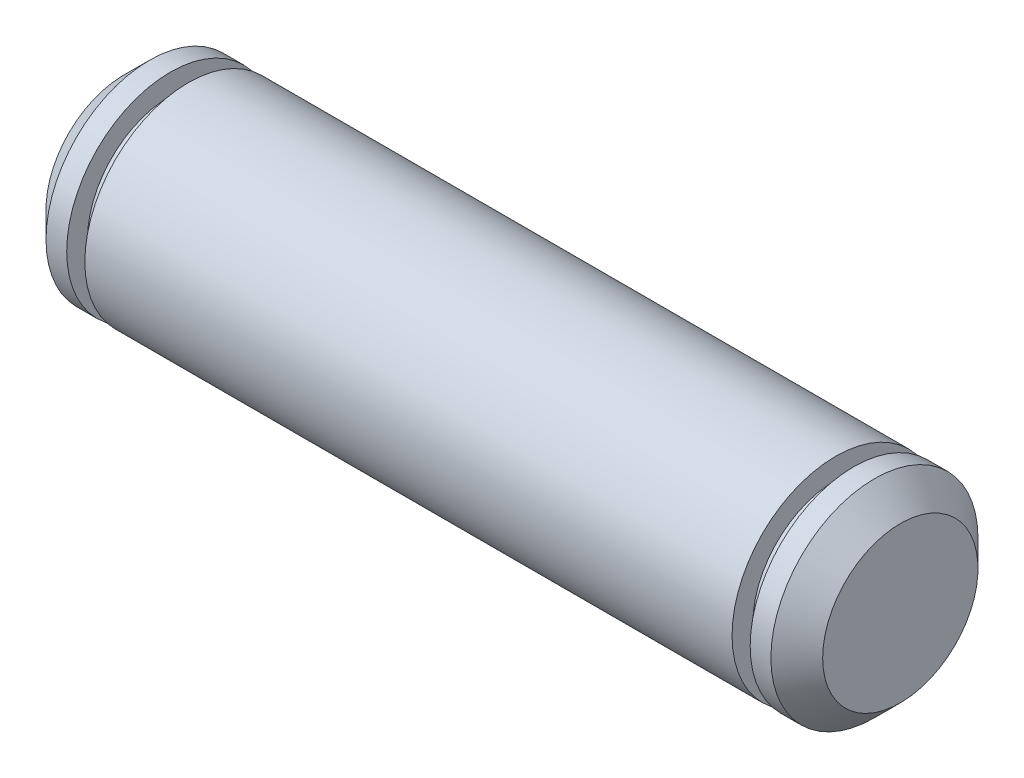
ISO-10303-21;
HEADER;
FILE_DESCRIPTION(('STEP AP214'),'2;1');
FILE_NAME('part.step','',(''),(''),'','','');
FILE_SCHEMA(('AUTOMOTIVE_DESIGN { 1 0 10303 214 1 1 1 1 }'));
ENDSEC;
DATA;
#1=APPLICATION_CONTEXT('core data for automotive mechanical design processes');
#2=APPLICATION_PROTOCOL_DEFINITION('international standard','automotive_design',2000,#1);
#3=PRODUCT_CONTEXT('',#1,'mechanical');
#4=PRODUCT('Part','Part','',(#3));
#5=PRODUCT_RELATED_PRODUCT_CATEGORY('part','',(#4));
#6=PRODUCT_DEFINITION_FORMATION('','',#4);
#7=PRODUCT_DEFINITION_CONTEXT('part definition',#1,'design');
#8=PRODUCT_DEFINITION('design','',#6,#7);
#9=PRODUCT_DEFINITION_SHAPE('','',#8);
#10=(LENGTH_UNIT() NAMED_UNIT(*) SI_UNIT(.MILLI.,.METRE.));
#11=(NAMED_UNIT(*) PLANE_ANGLE_UNIT() SI_UNIT($,.RADIAN.));
#12=(NAMED_UNIT(*) SI_UNIT($,.STERADIAN.) SOLID_ANGLE_UNIT());
#13=UNCERTAINTY_MEASURE_WITH_UNIT(LENGTH_MEASURE(1.E-05),#10,'distance_accuracy_value','');
#14=(GEOMETRIC_REPRESENTATION_CONTEXT(3) GLOBAL_UNCERTAINTY_ASSIGNED_CONTEXT((#13)) GLOBAL_UNIT_ASSIGNED_CONTEXT((#10,
#11,#12)) REPRESENTATION_CONTEXT('',''));
#15=CARTESIAN_POINT('',(0.,0.,0.));
#16=DIRECTION('',(0.,0.,1.));
#17=DIRECTION('',(1.,0.,0.));
#18=AXIS2_PLACEMENT_3D('',#15,#16,#17);
#19=CARTESIAN_POINT('',(-51.8,30.8,0.));
#20=DIRECTION('',(-1.,0.,0.));
#21=DIRECTION('',(0.,0.,1.));
#22=AXIS2_PLACEMENT_3D('',#19,#20,#21);
#23=PLANE('',#22);
#24=CARTESIAN_POINT('',(-51.8,26.8,0.));
#25=DIRECTION('',(-1.,0.,0.));
#26=DIRECTION('',(0.,0.,1.));
#27=AXIS2_PLACEMENT_3D('',#24,#25,#26);
#28=CIRCLE('',#27,3.);
#29=CARTESIAN_POINT('',(-51.8,26.8,3.));
#30=VERTEX_POINT('',#29);
#31=EDGE_CURVE('E10',#30,#30,#28,.F.);
#32=ORIENTED_EDGE('',*,*,#31,.T.);
#33=EDGE_LOOP('',(#32));
#34=FACE_BOUND('',#33,.T.);
#35=ADVANCED_FACE('F32',(#34),#23,.F.);
#36=CARTESIAN_POINT('',(-101.8,26.8,0.));
#37=DIRECTION('',(-1.,0.,0.));
#38=DIRECTION('',(0.,0.,1.));
#39=AXIS2_PLACEMENT_3D('',#36,#37,#38);
#40=CYLINDRICAL_SURFACE('',#39,4.00000000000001);
#41=CARTESIAN_POINT('',(-52.8,26.8,0.));
#42=DIRECTION('',(-1.,0.,0.));
#43=DIRECTION('',(0.,0.,1.));
#44=AXIS2_PLACEMENT_3D('',#41,#42,#43);
#45=CIRCLE('',#44,4.00000000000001);
#46=CARTESIAN_POINT('',(-52.8,26.8,4.00000000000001));
#47=VERTEX_POINT('',#46);
#48=EDGE_CURVE('E38',#47,#47,#45,.T.);
#49=ORIENTED_EDGE('',*,*,#48,.T.);
#50=EDGE_LOOP('',(#49));
#51=FACE_BOUND('',#50,.T.);
#52=CARTESIAN_POINT('',(-53.6,26.8,0.));
#53=DIRECTION('',(-1.,0.,0.));
#54=DIRECTION('',(0.,0.,1.));
#55=AXIS2_PLACEMENT_3D('',#52,#53,#54);
#56=CIRCLE('',#55,4.00000000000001);
#57=CARTESIAN_POINT('',(-53.6,26.8,4.00000000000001));
#58=VERTEX_POINT('',#57);
#59=EDGE_CURVE('E51',#58,#58,#56,.T.);
#60=ORIENTED_EDGE('',*,*,#59,.F.);
#61=EDGE_LOOP('',(#60));
#62=FACE_BOUND('',#61,.T.);
#63=ADVANCED_FACE('F117',(#51,#62),#40,.T.);
#64=CARTESIAN_POINT('',(-53.6,30.,0.));
#65=DIRECTION('',(1.,0.,0.));
#66=DIRECTION('',(0.,0.,-1.));
#67=AXIS2_PLACEMENT_3D('',#64,#65,#66);
#68=PLANE('',#67);
#69=CARTESIAN_POINT('',(-53.6,26.8,0.));
#70=DIRECTION('',(-1.,0.,0.));
#71=DIRECTION('',(0.,0.,1.));
#72=AXIS2_PLACEMENT_3D('',#69,#70,#71);
#73=CIRCLE('',#72,3.2);
#74=CARTESIAN_POINT('',(-53.6,26.8,3.2));
#75=VERTEX_POINT('',#74);
#76=EDGE_CURVE('E54',#75,#75,#73,.T.);
#77=ORIENTED_EDGE('',*,*,#76,.F.);
#78=EDGE_LOOP('',(#77));
#79=FACE_BOUND('',#78,.T.);
#80=ORIENTED_EDGE('',*,*,#59,.T.);
#81=EDGE_LOOP('',(#80));
#82=FACE_BOUND('',#81,.T.);
#83=ADVANCED_FACE('F111',(#79,#82),#68,.F.);
#84=CARTESIAN_POINT('',(-101.8,26.8,0.));
#85=DIRECTION('',(-1.,0.,0.));
#86=DIRECTION('',(0.,0.,1.));
#87=AXIS2_PLACEMENT_3D('',#84,#85,#86);
#88=CYLINDRICAL_SURFACE('',#87,3.2);
#89=CARTESIAN_POINT('',(-54.3,26.8,0.));
#90=DIRECTION('',(-1.,0.,0.));
#91=DIRECTION('',(0.,0.,1.));
#92=AXIS2_PLACEMENT_3D('',#89,#90,#91);
#93=CIRCLE('',#92,3.2);
#94=CARTESIAN_POINT('',(-54.3,26.8,3.2));
#95=VERTEX_POINT('',#94);
#96=EDGE_CURVE('E57',#95,#95,#93,.T.);
#97=ORIENTED_EDGE('',*,*,#96,.F.);
#98=EDGE_LOOP('',(#97));
#99=FACE_BOUND('',#98,.T.);
#100=ORIENTED_EDGE('',*,*,#76,.T.);
#101=EDGE_LOOP('',(#100));
#102=FACE_BOUND('',#101,.T.);
#103=ADVANCED_FACE('F105',(#99,#102),#88,.T.);
#104=CARTESIAN_POINT('',(-54.3,30.8,0.));
#105=DIRECTION('',(-1.,0.,0.));
#106=DIRECTION('',(0.,0.,1.));
#107=AXIS2_PLACEMENT_3D('',#104,#105,#106);
#108=PLANE('',#107);
#109=CARTESIAN_POINT('',(-54.3,26.8,0.));
#110=DIRECTION('',(-1.,0.,0.));
#111=DIRECTION('',(0.,0.,1.));
#112=AXIS2_PLACEMENT_3D('',#109,#110,#111);
#113=CIRCLE('',#112,4.00000000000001);
#114=CARTESIAN_POINT('',(-54.3,26.8,4.00000000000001));
#115=VERTEX_POINT('',#114);
#116=EDGE_CURVE('E60',#115,#115,#113,.T.);
#117=ORIENTED_EDGE('',*,*,#116,.F.);
#118=EDGE_LOOP('',(#117));
#119=FACE_BOUND('',#118,.T.);
#120=ORIENTED_EDGE('',*,*,#96,.T.);
#121=EDGE_LOOP('',(#120));
#122=FACE_BOUND('',#121,.T.);
#123=ADVANCED_FACE('F99',(#119,#122),#108,.F.);
#124=CARTESIAN_POINT('',(-101.8,26.8,0.));
#125=DIRECTION('',(-1.,0.,0.));
#126=DIRECTION('',(0.,0.,1.));
#127=AXIS2_PLACEMENT_3D('',#124,#125,#126);
#128=CYLINDRICAL_SURFACE('',#127,4.00000000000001);
#129=CARTESIAN_POINT('',(-79.3,26.8,0.));
#130=DIRECTION('',(-1.,0.,0.));
#131=DIRECTION('',(0.,0.,1.));
#132=AXIS2_PLACEMENT_3D('',#129,#130,#131);
#133=CIRCLE('',#132,4.00000000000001);
#134=CARTESIAN_POINT('',(-79.3,26.8,4.00000000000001));
#135=VERTEX_POINT('',#134);
#136=EDGE_CURVE('E63',#135,#135,#133,.T.);
#137=ORIENTED_EDGE('',*,*,#136,.F.);
#138=EDGE_LOOP('',(#137));
#139=FACE_BOUND('',#138,.T.);
#140=ORIENTED_EDGE('',*,*,#116,.T.);
#141=EDGE_LOOP('',(#140));
#142=FACE_BOUND('',#141,.T.);
#143=ADVANCED_FACE('F93',(#139,#142),#128,.T.);
#144=CARTESIAN_POINT('',(-79.3,30.,0.));
#145=DIRECTION('',(1.,0.,0.));
#146=DIRECTION('',(0.,0.,-1.));
#147=AXIS2_PLACEMENT_3D('',#144,#145,#146);
#148=PLANE('',#147);
#149=CARTESIAN_POINT('',(-79.3,26.8,0.));
#150=DIRECTION('',(-1.,0.,0.));
#151=DIRECTION('',(0.,0.,1.));
#152=AXIS2_PLACEMENT_3D('',#149,#150,#151);
#153=CIRCLE('',#152,3.20000000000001);
#154=CARTESIAN_POINT('',(-79.3,26.8,3.20000000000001));
#155=VERTEX_POINT('',#154);
#156=EDGE_CURVE('E66',#155,#155,#153,.T.);
#157=ORIENTED_EDGE('',*,*,#156,.F.);
#158=EDGE_LOOP('',(#157));
#159=FACE_BOUND('',#158,.T.);
#160=ORIENTED_EDGE('',*,*,#136,.T.);
#161=EDGE_LOOP('',(#160));
#162=FACE_BOUND('',#161,.T.);
#163=ADVANCED_FACE('F87',(#159,#162),#148,.F.);
#164=CARTESIAN_POINT('',(-101.8,26.8,0.));
#165=DIRECTION('',(-1.,0.,0.));
#166=DIRECTION('',(0.,0.,1.));
#167=AXIS2_PLACEMENT_3D('',#164,#165,#166);
#168=CYLINDRICAL_SURFACE('',#167,3.20000000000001);
#169=CARTESIAN_POINT('',(-80.,26.8,0.));
#170=DIRECTION('',(-1.,0.,0.));
#171=DIRECTION('',(0.,0.,1.));
#172=AXIS2_PLACEMENT_3D('',#169,#170,#171);
#173=CIRCLE('',#172,3.20000000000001);
#174=CARTESIAN_POINT('',(-80.,26.8,3.20000000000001));
#175=VERTEX_POINT('',#174);
#176=EDGE_CURVE('E69',#175,#175,#173,.T.);
#177=ORIENTED_EDGE('',*,*,#176,.F.);
#178=EDGE_LOOP('',(#177));
#179=FACE_BOUND('',#178,.T.);
#180=ORIENTED_EDGE('',*,*,#156,.T.);
#181=EDGE_LOOP('',(#180));
#182=FACE_BOUND('',#181,.T.);
#183=ADVANCED_FACE('F81',(#179,#182),#168,.T.);
#184=CARTESIAN_POINT('',(-80.,30.8,0.));
#185=DIRECTION('',(-1.,0.,0.));
#186=DIRECTION('',(0.,0.,1.));
#187=AXIS2_PLACEMENT_3D('',#184,#185,#186);
#188=PLANE('',#187);
#189=CARTESIAN_POINT('',(-80.,26.8,0.));
#190=DIRECTION('',(-1.,0.,0.));
#191=DIRECTION('',(0.,0.,1.));
#192=AXIS2_PLACEMENT_3D('',#189,#190,#191);
#193=CIRCLE('',#192,4.00000000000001);
#194=CARTESIAN_POINT('',(-80.,26.8,4.00000000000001));
#195=VERTEX_POINT('',#194);
#196=EDGE_CURVE('E72',#195,#195,#193,.T.);
#197=ORIENTED_EDGE('',*,*,#196,.F.);
#198=EDGE_LOOP('',(#197));
#199=FACE_BOUND('',#198,.T.);
#200=ORIENTED_EDGE('',*,*,#176,.T.);
#201=EDGE_LOOP('',(#200));
#202=FACE_BOUND('',#201,.T.);
#203=ADVANCED_FACE('F78',(#199,#202),#188,.F.);
#204=CARTESIAN_POINT('',(-101.8,26.8,0.));
#205=DIRECTION('',(-1.,0.,0.));
#206=DIRECTION('',(0.,0.,1.));
#207=AXIS2_PLACEMENT_3D('',#204,#205,#206);
#208=CYLINDRICAL_SURFACE('',#207,4.00000000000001);
#209=CARTESIAN_POINT('',(-80.8,26.8,0.));
#210=DIRECTION('',(1.,0.,0.));
#211=DIRECTION('',(0.,0.,-1.));
#212=AXIS2_PLACEMENT_3D('',#209,#210,#211);
#213=CIRCLE('',#212,4.00000000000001);
#214=CARTESIAN_POINT('',(-80.8,26.8,-4.00000000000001));
#215=VERTEX_POINT('',#214);
#216=EDGE_CURVE('E42',#215,#215,#213,.T.);
#217=ORIENTED_EDGE('',*,*,#216,.T.);
#218=EDGE_LOOP('',(#217));
#219=FACE_BOUND('',#218,.T.);
#220=ORIENTED_EDGE('',*,*,#196,.T.);
#221=EDGE_LOOP('',(#220));
#222=FACE_BOUND('',#221,.T.);
#223=ADVANCED_FACE('F76',(#219,#222),#208,.T.);
#224=CARTESIAN_POINT('',(-81.8,26.8,0.));
#225=DIRECTION('',(1.,0.,0.));
#226=DIRECTION('',(0.,0.,-1.));
#227=AXIS2_PLACEMENT_3D('',#224,#225,#226);
#228=PLANE('',#227);
#229=CARTESIAN_POINT('',(-81.8,26.8,0.));
#230=DIRECTION('',(1.,0.,0.));
#231=DIRECTION('',(0.,0.,-1.));
#232=AXIS2_PLACEMENT_3D('',#229,#230,#231);
#233=CIRCLE('',#232,2.99999999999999);
#234=CARTESIAN_POINT('',(-81.8,26.8,-2.99999999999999));
#235=VERTEX_POINT('',#234);
#236=EDGE_CURVE('E46',#235,#235,#233,.F.);
#237=ORIENTED_EDGE('',*,*,#236,.T.);
#238=EDGE_LOOP('',(#237));
#239=FACE_BOUND('',#238,.T.);
#240=ADVANCED_FACE('F128',(#239),#228,.F.);
#241=CARTESIAN_POINT('',(-81.8,26.8,0.));
#242=DIRECTION('',(1.,0.,0.));
#243=DIRECTION('',(0.,0.,-1.));
#244=AXIS2_PLACEMENT_3D('',#241,#242,#243);
#245=CONICAL_SURFACE('',#244,2.99999999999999,0.785398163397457);
#246=ORIENTED_EDGE('',*,*,#216,.F.);
#247=EDGE_LOOP('',(#246));
#248=FACE_BOUND('',#247,.T.);
#249=ORIENTED_EDGE('',*,*,#236,.F.);
#250=EDGE_LOOP('',(#249));
#251=FACE_BOUND('',#250,.T.);
#252=ADVANCED_FACE('F132',(#248,#251),#245,.T.);
#253=CARTESIAN_POINT('',(-52.8,26.8,0.));
#254=DIRECTION('',(-1.,0.,0.));
#255=DIRECTION('',(0.,0.,1.));
#256=AXIS2_PLACEMENT_3D('',#253,#254,#255);
#257=CONICAL_SURFACE('',#256,4.00000000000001,0.785398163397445);
#258=ORIENTED_EDGE('',*,*,#31,.F.);
#259=EDGE_LOOP('',(#258));
#260=FACE_BOUND('',#259,.T.);
#261=ORIENTED_EDGE('',*,*,#48,.F.);
#262=EDGE_LOOP('',(#261));
#263=FACE_BOUND('',#262,.T.);
#264=ADVANCED_FACE('F136',(#260,#263),#257,.T.);
#265=CLOSED_SHELL('',(#35,#63,#83,#103,#123,#143,#163,#183,#203,#223,#240,#252,#264));
#266=MANIFOLD_SOLID_BREP('B2',#265);
#267=ADVANCED_BREP_SHAPE_REPRESENTATION('',(#18,#266),#14);
#268=SHAPE_DEFINITION_REPRESENTATION(#9,#267);
ENDSEC;
END-ISO-10303-21;
